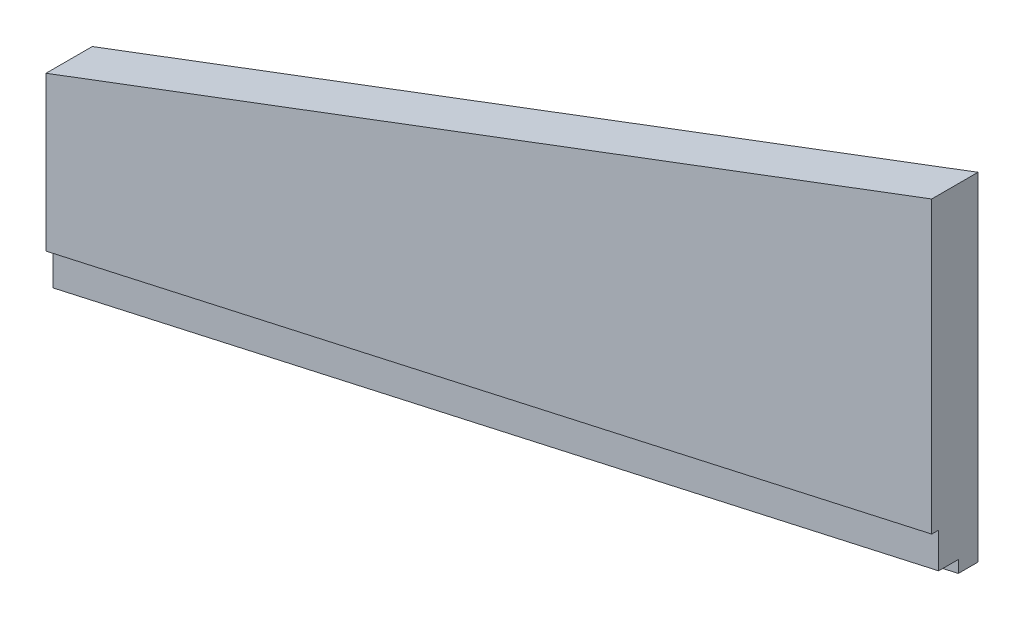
from build123d import *

# Parameters (mm, degrees)
EXTRUDE_1_DEPTH = 47
EXTRUDE_2_DEPTH = 40
EXTRUDE_3_DEPTH = 20


with BuildPart() as part:
    # Sketch 1 → Extrude 1 (new body)
    with BuildSketch(Plane.XY):
        Polygon((0, -931.846836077), (0, -1226.738436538), (-900, -1427.719077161), (-900, -1271.209662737), align=None)
    extrude(amount=EXTRUDE_1_DEPTH)

    # Sketch 2 → Extrude 2 (add)
    with BuildSketch(Plane(origin=(0, 0, 0), x_dir=(-1, 0, 0), z_dir=(0, 0, -1))):
        Polygon((0, -1226.738436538), (0, -1262.600512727), (900, -1463.58115335), (900, -1427.719077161), align=None)
    extrude(amount=-EXTRUDE_2_DEPTH)

    # Sketch 3 → Extrude 3 (add)
    with BuildSketch(Plane(origin=(0, 0, 0), x_dir=(-1, 0, 0), z_dir=(0, 0, -1))):
        Polygon((0, -1262.600512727), (0, -1274.896081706), (900, -1475.876722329), (900, -1463.58115335), align=None)
    extrude(amount=-EXTRUDE_3_DEPTH)


solid = part.part
